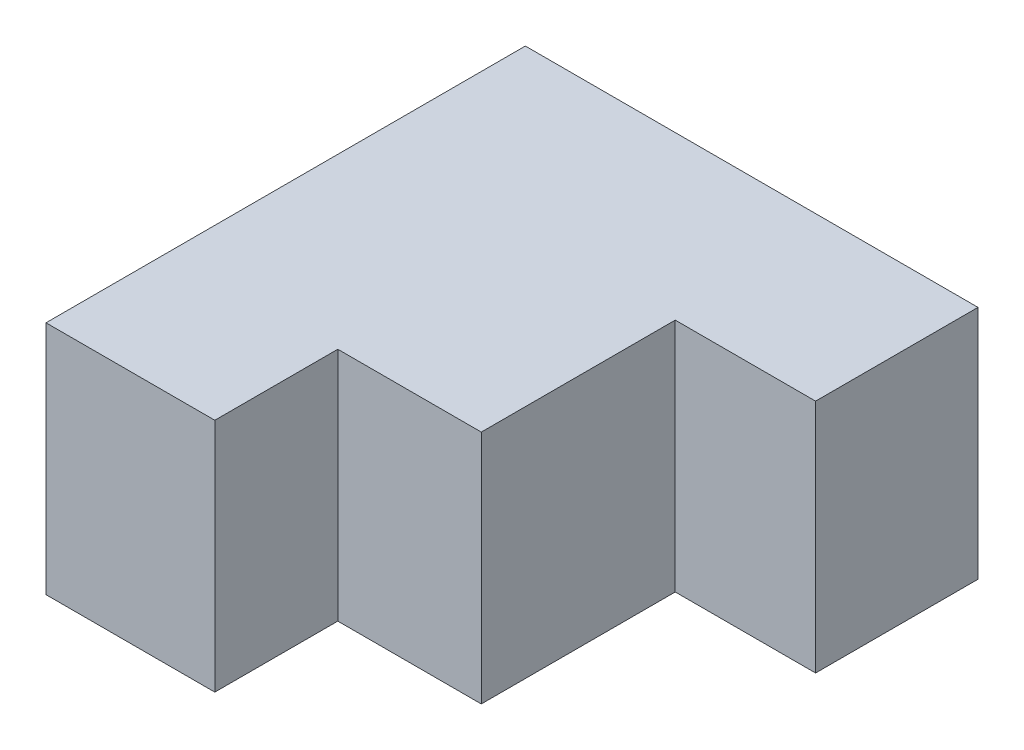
ISO-10303-21;
HEADER;
FILE_DESCRIPTION(('STEP AP214'),'2;1');
FILE_NAME('part.step','',(''),(''),'','','');
FILE_SCHEMA(('AUTOMOTIVE_DESIGN { 1 0 10303 214 1 1 1 1 }'));
ENDSEC;
DATA;
#1=APPLICATION_CONTEXT('core data for automotive mechanical design processes');
#2=APPLICATION_PROTOCOL_DEFINITION('international standard','automotive_design',2000,#1);
#3=PRODUCT_CONTEXT('',#1,'mechanical');
#4=PRODUCT('Part','Part','',(#3));
#5=PRODUCT_RELATED_PRODUCT_CATEGORY('part','',(#4));
#6=PRODUCT_DEFINITION_FORMATION('','',#4);
#7=PRODUCT_DEFINITION_CONTEXT('part definition',#1,'design');
#8=PRODUCT_DEFINITION('design','',#6,#7);
#9=PRODUCT_DEFINITION_SHAPE('','',#8);
#10=(LENGTH_UNIT() NAMED_UNIT(*) SI_UNIT(.MILLI.,.METRE.));
#11=(NAMED_UNIT(*) PLANE_ANGLE_UNIT() SI_UNIT($,.RADIAN.));
#12=(NAMED_UNIT(*) SI_UNIT($,.STERADIAN.) SOLID_ANGLE_UNIT());
#13=UNCERTAINTY_MEASURE_WITH_UNIT(LENGTH_MEASURE(1.E-05),#10,'distance_accuracy_value','');
#14=(GEOMETRIC_REPRESENTATION_CONTEXT(3) GLOBAL_UNCERTAINTY_ASSIGNED_CONTEXT((#13)) GLOBAL_UNIT_ASSIGNED_CONTEXT((#10,
#11,#12)) REPRESENTATION_CONTEXT('',''));
#15=CARTESIAN_POINT('',(0.,0.,0.));
#16=DIRECTION('',(0.,0.,1.));
#17=DIRECTION('',(1.,0.,0.));
#18=AXIS2_PLACEMENT_3D('',#15,#16,#17);
#19=CARTESIAN_POINT('',(28.6773483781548,40.,0.));
#20=DIRECTION('',(0.,0.,-1.));
#21=DIRECTION('',(-1.,0.,0.));
#22=AXIS2_PLACEMENT_3D('',#19,#20,#21);
#23=PLANE('',#22);
#24=DIRECTION('',(1.,0.,0.));
#25=VECTOR('',#24,1.);
#26=CARTESIAN_POINT('',(28.6773483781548,0.,0.));
#27=LINE('',#26,#25);
#28=CARTESIAN_POINT('',(0.,0.,0.));
#29=VERTEX_POINT('',#28);
#30=CARTESIAN_POINT('',(28.6773483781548,0.,0.));
#31=VERTEX_POINT('',#30);
#32=EDGE_CURVE('E144',#29,#31,#27,.T.);
#33=ORIENTED_EDGE('',*,*,#32,.T.);
#34=DIRECTION('',(0.,-1.,0.));
#35=VECTOR('',#34,1.);
#36=CARTESIAN_POINT('',(28.6773483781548,40.,0.));
#37=LINE('',#36,#35);
#38=CARTESIAN_POINT('',(28.6773483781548,40.,0.));
#39=VERTEX_POINT('',#38);
#40=EDGE_CURVE('E11',#39,#31,#37,.T.);
#41=ORIENTED_EDGE('',*,*,#40,.F.);
#42=DIRECTION('',(1.,0.,0.));
#43=VECTOR('',#42,1.);
#44=CARTESIAN_POINT('',(28.6773483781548,40.,0.));
#45=LINE('',#44,#43);
#46=CARTESIAN_POINT('',(0.,40.,0.));
#47=VERTEX_POINT('',#46);
#48=EDGE_CURVE('E166',#47,#39,#45,.T.);
#49=ORIENTED_EDGE('',*,*,#48,.F.);
#50=DIRECTION('',(0.,-1.,0.));
#51=VECTOR('',#50,1.);
#52=CARTESIAN_POINT('',(0.,40.,0.));
#53=LINE('',#52,#51);
#54=EDGE_CURVE('E140',#47,#29,#53,.T.);
#55=ORIENTED_EDGE('',*,*,#54,.T.);
#56=EDGE_LOOP('',(#33,#41,#49,#55));
#57=FACE_BOUND('',#56,.T.);
#58=ADVANCED_FACE('F43',(#57),#23,.F.);
#59=CARTESIAN_POINT('',(28.6773483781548,40.,-20.8935483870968));
#60=DIRECTION('',(-1.,0.,0.));
#61=DIRECTION('',(0.,0.,1.));
#62=AXIS2_PLACEMENT_3D('',#59,#60,#61);
#63=PLANE('',#62);
#64=DIRECTION('',(0.,0.,-1.));
#65=VECTOR('',#64,1.);
#66=CARTESIAN_POINT('',(28.6773483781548,0.,-20.8935483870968));
#67=LINE('',#66,#65);
#68=CARTESIAN_POINT('',(28.6773483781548,0.,-20.8935483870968));
#69=VERTEX_POINT('',#68);
#70=EDGE_CURVE('E148',#31,#69,#67,.T.);
#71=ORIENTED_EDGE('',*,*,#70,.T.);
#72=DIRECTION('',(0.,-1.,0.));
#73=VECTOR('',#72,1.);
#74=CARTESIAN_POINT('',(28.6773483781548,40.,-20.8935483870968));
#75=LINE('',#74,#73);
#76=CARTESIAN_POINT('',(28.6773483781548,40.,-20.8935483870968));
#77=VERTEX_POINT('',#76);
#78=EDGE_CURVE('E52',#77,#69,#75,.T.);
#79=ORIENTED_EDGE('',*,*,#78,.F.);
#80=DIRECTION('',(0.,0.,-1.));
#81=VECTOR('',#80,1.);
#82=CARTESIAN_POINT('',(28.6773483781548,40.,-20.8935483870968));
#83=LINE('',#82,#81);
#84=EDGE_CURVE('E103',#39,#77,#83,.T.);
#85=ORIENTED_EDGE('',*,*,#84,.F.);
#86=ORIENTED_EDGE('',*,*,#40,.T.);
#87=EDGE_LOOP('',(#71,#79,#85,#86));
#88=FACE_BOUND('',#87,.T.);
#89=ADVANCED_FACE('F212',(#88),#63,.F.);
#90=CARTESIAN_POINT('',(53.0531548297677,40.,-20.8935483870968));
#91=DIRECTION('',(0.,0.,-1.));
#92=DIRECTION('',(-1.,0.,0.));
#93=AXIS2_PLACEMENT_3D('',#90,#91,#92);
#94=PLANE('',#93);
#95=DIRECTION('',(1.,0.,0.));
#96=VECTOR('',#95,1.);
#97=CARTESIAN_POINT('',(53.0531548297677,0.,-20.8935483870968));
#98=LINE('',#97,#96);
#99=CARTESIAN_POINT('',(53.0531548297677,0.,-20.8935483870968));
#100=VERTEX_POINT('',#99);
#101=EDGE_CURVE('E151',#69,#100,#98,.T.);
#102=ORIENTED_EDGE('',*,*,#101,.T.);
#103=DIRECTION('',(0.,-1.,0.));
#104=VECTOR('',#103,1.);
#105=CARTESIAN_POINT('',(53.0531548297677,40.,-20.8935483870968));
#106=LINE('',#105,#104);
#107=CARTESIAN_POINT('',(53.0531548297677,40.,-20.8935483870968));
#108=VERTEX_POINT('',#107);
#109=EDGE_CURVE('E177',#108,#100,#106,.T.);
#110=ORIENTED_EDGE('',*,*,#109,.F.);
#111=DIRECTION('',(1.,0.,0.));
#112=VECTOR('',#111,1.);
#113=CARTESIAN_POINT('',(53.0531548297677,40.,-20.8935483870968));
#114=LINE('',#113,#112);
#115=EDGE_CURVE('E187',#77,#108,#114,.T.);
#116=ORIENTED_EDGE('',*,*,#115,.F.);
#117=ORIENTED_EDGE('',*,*,#78,.T.);
#118=EDGE_LOOP('',(#102,#110,#116,#117));
#119=FACE_BOUND('',#118,.T.);
#120=ADVANCED_FACE('F185',(#119),#94,.F.);
#121=CARTESIAN_POINT('',(53.0531548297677,40.,-53.8410669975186));
#122=DIRECTION('',(-1.,0.,0.));
#123=DIRECTION('',(0.,0.,1.));
#124=AXIS2_PLACEMENT_3D('',#121,#122,#123);
#125=PLANE('',#124);
#126=DIRECTION('',(0.,0.,-1.));
#127=VECTOR('',#126,1.);
#128=CARTESIAN_POINT('',(53.0531548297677,0.,-53.8410669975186));
#129=LINE('',#128,#127);
#130=CARTESIAN_POINT('',(53.0531548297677,0.,-53.8410669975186));
#131=VERTEX_POINT('',#130);
#132=EDGE_CURVE('E154',#100,#131,#129,.T.);
#133=ORIENTED_EDGE('',*,*,#132,.T.);
#134=DIRECTION('',(0.,-1.,0.));
#135=VECTOR('',#134,1.);
#136=CARTESIAN_POINT('',(53.0531548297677,40.,-53.8410669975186));
#137=LINE('',#136,#135);
#138=CARTESIAN_POINT('',(53.0531548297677,40.,-53.8410669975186));
#139=VERTEX_POINT('',#138);
#140=EDGE_CURVE('E173',#139,#131,#137,.T.);
#141=ORIENTED_EDGE('',*,*,#140,.F.);
#142=DIRECTION('',(0.,0.,-1.));
#143=VECTOR('',#142,1.);
#144=CARTESIAN_POINT('',(53.0531548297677,40.,-53.8410669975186));
#145=LINE('',#144,#143);
#146=EDGE_CURVE('E200',#108,#139,#145,.T.);
#147=ORIENTED_EDGE('',*,*,#146,.F.);
#148=ORIENTED_EDGE('',*,*,#109,.T.);
#149=EDGE_LOOP('',(#133,#141,#147,#148));
#150=FACE_BOUND('',#149,.T.);
#151=ADVANCED_FACE('F195',(#150),#125,.F.);
#152=CARTESIAN_POINT('',(76.8932292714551,40.,-53.8410669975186));
#153=DIRECTION('',(0.,0.,-1.));
#154=DIRECTION('',(-1.,0.,0.));
#155=AXIS2_PLACEMENT_3D('',#152,#153,#154);
#156=PLANE('',#155);
#157=DIRECTION('',(1.,0.,0.));
#158=VECTOR('',#157,1.);
#159=CARTESIAN_POINT('',(76.8932292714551,0.,-53.8410669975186));
#160=LINE('',#159,#158);
#161=CARTESIAN_POINT('',(76.8932292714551,0.,-53.8410669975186));
#162=VERTEX_POINT('',#161);
#163=EDGE_CURVE('E157',#131,#162,#160,.T.);
#164=ORIENTED_EDGE('',*,*,#163,.T.);
#165=DIRECTION('',(0.,-1.,0.));
#166=VECTOR('',#165,1.);
#167=CARTESIAN_POINT('',(76.8932292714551,40.,-53.8410669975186));
#168=LINE('',#167,#166);
#169=CARTESIAN_POINT('',(76.8932292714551,40.,-53.8410669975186));
#170=VERTEX_POINT('',#169);
#171=EDGE_CURVE('E133',#170,#162,#168,.T.);
#172=ORIENTED_EDGE('',*,*,#171,.F.);
#173=DIRECTION('',(1.,0.,0.));
#174=VECTOR('',#173,1.);
#175=CARTESIAN_POINT('',(76.8932292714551,40.,-53.8410669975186));
#176=LINE('',#175,#174);
#177=EDGE_CURVE('E122',#139,#170,#176,.T.);
#178=ORIENTED_EDGE('',*,*,#177,.F.);
#179=ORIENTED_EDGE('',*,*,#140,.T.);
#180=EDGE_LOOP('',(#164,#172,#178,#179));
#181=FACE_BOUND('',#180,.T.);
#182=ADVANCED_FACE('F198',(#181),#156,.F.);
#183=CARTESIAN_POINT('',(76.8932292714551,40.,-81.4312655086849));
#184=DIRECTION('',(-1.,0.,0.));
#185=DIRECTION('',(0.,0.,1.));
#186=AXIS2_PLACEMENT_3D('',#183,#184,#185);
#187=PLANE('',#186);
#188=DIRECTION('',(0.,0.,-1.));
#189=VECTOR('',#188,1.);
#190=CARTESIAN_POINT('',(76.8932292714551,0.,-81.4312655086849));
#191=LINE('',#190,#189);
#192=CARTESIAN_POINT('',(76.8932292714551,0.,-81.4312655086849));
#193=VERTEX_POINT('',#192);
#194=EDGE_CURVE('E131',#162,#193,#191,.T.);
#195=ORIENTED_EDGE('',*,*,#194,.T.);
#196=DIRECTION('',(0.,-1.,0.));
#197=VECTOR('',#196,1.);
#198=CARTESIAN_POINT('',(76.8932292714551,40.,-81.4312655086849));
#199=LINE('',#198,#197);
#200=CARTESIAN_POINT('',(76.8932292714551,40.,-81.4312655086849));
#201=VERTEX_POINT('',#200);
#202=EDGE_CURVE('E128',#201,#193,#199,.T.);
#203=ORIENTED_EDGE('',*,*,#202,.F.);
#204=DIRECTION('',(0.,0.,-1.));
#205=VECTOR('',#204,1.);
#206=CARTESIAN_POINT('',(76.8932292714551,40.,-81.4312655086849));
#207=LINE('',#206,#205);
#208=EDGE_CURVE('E116',#170,#201,#207,.T.);
#209=ORIENTED_EDGE('',*,*,#208,.F.);
#210=ORIENTED_EDGE('',*,*,#171,.T.);
#211=EDGE_LOOP('',(#195,#203,#209,#210));
#212=FACE_BOUND('',#211,.T.);
#213=ADVANCED_FACE('F129',(#212),#187,.F.);
#214=CARTESIAN_POINT('',(0.,40.,-81.4312655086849));
#215=DIRECTION('',(0.,0.,1.));
#216=DIRECTION('',(1.,0.,0.));
#217=AXIS2_PLACEMENT_3D('',#214,#215,#216);
#218=PLANE('',#217);
#219=DIRECTION('',(-1.,0.,0.));
#220=VECTOR('',#219,1.);
#221=CARTESIAN_POINT('',(0.,0.,-81.4312655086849));
#222=LINE('',#221,#220);
#223=CARTESIAN_POINT('',(0.,0.,-81.4312655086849));
#224=VERTEX_POINT('',#223);
#225=EDGE_CURVE('E89',#193,#224,#222,.T.);
#226=ORIENTED_EDGE('',*,*,#225,.T.);
#227=DIRECTION('',(0.,-1.,0.));
#228=VECTOR('',#227,1.);
#229=CARTESIAN_POINT('',(0.,40.,-81.4312655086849));
#230=LINE('',#229,#228);
#231=CARTESIAN_POINT('',(0.,40.,-81.4312655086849));
#232=VERTEX_POINT('',#231);
#233=EDGE_CURVE('E134',#232,#224,#230,.T.);
#234=ORIENTED_EDGE('',*,*,#233,.F.);
#235=DIRECTION('',(-1.,0.,0.));
#236=VECTOR('',#235,1.);
#237=CARTESIAN_POINT('',(0.,40.,-81.4312655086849));
#238=LINE('',#237,#236);
#239=EDGE_CURVE('E120',#201,#232,#238,.T.);
#240=ORIENTED_EDGE('',*,*,#239,.F.);
#241=ORIENTED_EDGE('',*,*,#202,.T.);
#242=EDGE_LOOP('',(#226,#234,#240,#241));
#243=FACE_BOUND('',#242,.T.);
#244=ADVANCED_FACE('F136',(#243),#218,.F.);
#245=CARTESIAN_POINT('',(0.,40.,0.));
#246=DIRECTION('',(1.,0.,0.));
#247=DIRECTION('',(0.,0.,-1.));
#248=AXIS2_PLACEMENT_3D('',#245,#246,#247);
#249=PLANE('',#248);
#250=DIRECTION('',(0.,0.,1.));
#251=VECTOR('',#250,1.);
#252=CARTESIAN_POINT('',(0.,0.,0.));
#253=LINE('',#252,#251);
#254=EDGE_CURVE('E95',#224,#29,#253,.T.);
#255=ORIENTED_EDGE('',*,*,#254,.T.);
#256=ORIENTED_EDGE('',*,*,#54,.F.);
#257=DIRECTION('',(0.,0.,1.));
#258=VECTOR('',#257,1.);
#259=CARTESIAN_POINT('',(0.,40.,0.));
#260=LINE('',#259,#258);
#261=EDGE_CURVE('E60',#232,#47,#260,.T.);
#262=ORIENTED_EDGE('',*,*,#261,.F.);
#263=ORIENTED_EDGE('',*,*,#233,.T.);
#264=EDGE_LOOP('',(#255,#256,#262,#263));
#265=FACE_BOUND('',#264,.T.);
#266=ADVANCED_FACE('F228',(#265),#249,.F.);
#267=CARTESIAN_POINT('',(0.,40.,0.));
#268=DIRECTION('',(0.,-1.,0.));
#269=DIRECTION('',(0.,0.,-1.));
#270=AXIS2_PLACEMENT_3D('',#267,#268,#269);
#271=PLANE('',#270);
#272=ORIENTED_EDGE('',*,*,#48,.T.);
#273=ORIENTED_EDGE('',*,*,#84,.T.);
#274=ORIENTED_EDGE('',*,*,#115,.T.);
#275=ORIENTED_EDGE('',*,*,#146,.T.);
#276=ORIENTED_EDGE('',*,*,#177,.T.);
#277=ORIENTED_EDGE('',*,*,#208,.T.);
#278=ORIENTED_EDGE('',*,*,#239,.T.);
#279=ORIENTED_EDGE('',*,*,#261,.T.);
#280=EDGE_LOOP('',(#272,#273,#274,#275,#276,#277,#278,#279));
#281=FACE_BOUND('',#280,.T.);
#282=ADVANCED_FACE('F118',(#281),#271,.F.);
#283=CARTESIAN_POINT('',(0.,0.,0.));
#284=DIRECTION('',(0.,-1.,0.));
#285=DIRECTION('',(0.,0.,-1.));
#286=AXIS2_PLACEMENT_3D('',#283,#284,#285);
#287=PLANE('',#286);
#288=ORIENTED_EDGE('',*,*,#32,.F.);
#289=ORIENTED_EDGE('',*,*,#254,.F.);
#290=ORIENTED_EDGE('',*,*,#225,.F.);
#291=ORIENTED_EDGE('',*,*,#194,.F.);
#292=ORIENTED_EDGE('',*,*,#163,.F.);
#293=ORIENTED_EDGE('',*,*,#132,.F.);
#294=ORIENTED_EDGE('',*,*,#101,.F.);
#295=ORIENTED_EDGE('',*,*,#70,.F.);
#296=EDGE_LOOP('',(#288,#289,#290,#291,#292,#293,#294,#295));
#297=FACE_BOUND('',#296,.T.);
#298=ADVANCED_FACE('F191',(#297),#287,.T.);
#299=CLOSED_SHELL('',(#58,#89,#120,#151,#182,#213,#244,#266,#282,#298));
#300=MANIFOLD_SOLID_BREP('B2',#299);
#301=ADVANCED_BREP_SHAPE_REPRESENTATION('',(#18,#300),#14);
#302=SHAPE_DEFINITION_REPRESENTATION(#9,#301);
ENDSEC;
END-ISO-10303-21;
